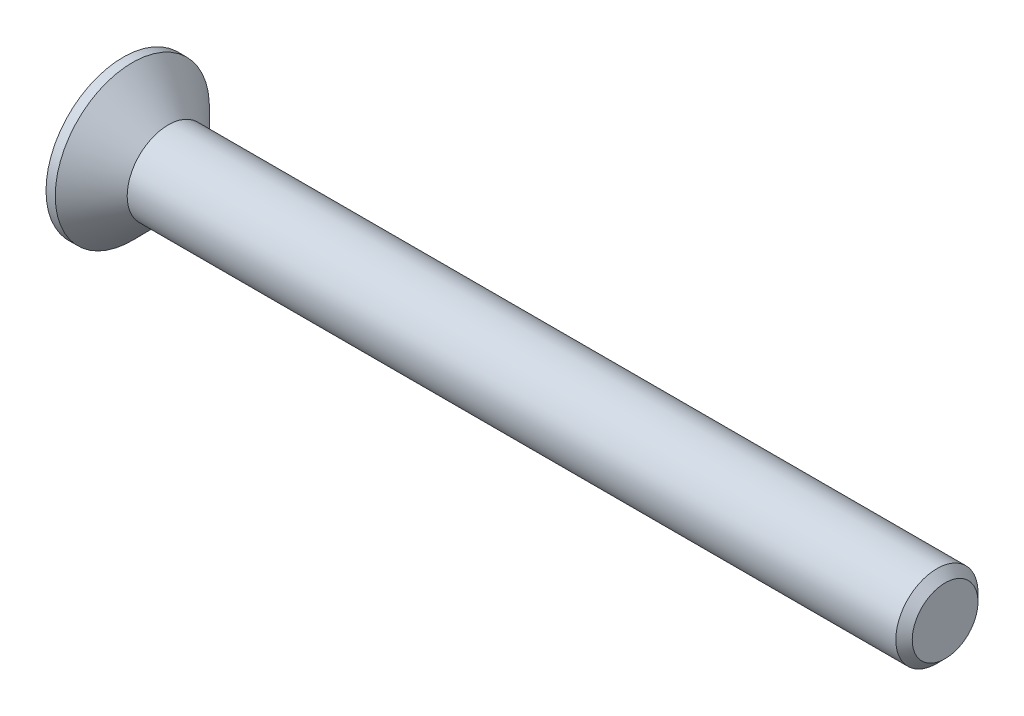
ISO-10303-21;
HEADER;
FILE_DESCRIPTION(('STEP AP214'),'2;1');
FILE_NAME('part.step','',(''),(''),'','','');
FILE_SCHEMA(('AUTOMOTIVE_DESIGN { 1 0 10303 214 1 1 1 1 }'));
ENDSEC;
DATA;
#1=APPLICATION_CONTEXT('core data for automotive mechanical design processes');
#2=APPLICATION_PROTOCOL_DEFINITION('international standard','automotive_design',2000,#1);
#3=PRODUCT_CONTEXT('',#1,'mechanical');
#4=PRODUCT('Part','Part','',(#3));
#5=PRODUCT_RELATED_PRODUCT_CATEGORY('part','',(#4));
#6=PRODUCT_DEFINITION_FORMATION('','',#4);
#7=PRODUCT_DEFINITION_CONTEXT('part definition',#1,'design');
#8=PRODUCT_DEFINITION('design','',#6,#7);
#9=PRODUCT_DEFINITION_SHAPE('','',#8);
#10=(LENGTH_UNIT() NAMED_UNIT(*) SI_UNIT(.MILLI.,.METRE.));
#11=(NAMED_UNIT(*) PLANE_ANGLE_UNIT() SI_UNIT($,.RADIAN.));
#12=(NAMED_UNIT(*) SI_UNIT($,.STERADIAN.) SOLID_ANGLE_UNIT());
#13=UNCERTAINTY_MEASURE_WITH_UNIT(LENGTH_MEASURE(1.E-05),#10,'distance_accuracy_value','');
#14=(GEOMETRIC_REPRESENTATION_CONTEXT(3) GLOBAL_UNCERTAINTY_ASSIGNED_CONTEXT((#13)) GLOBAL_UNIT_ASSIGNED_CONTEXT((#10,
#11,#12)) REPRESENTATION_CONTEXT('',''));
#15=CARTESIAN_POINT('',(0.,0.,0.));
#16=DIRECTION('',(0.,0.,1.));
#17=DIRECTION('',(1.,0.,0.));
#18=AXIS2_PLACEMENT_3D('',#15,#16,#17);
#19=CARTESIAN_POINT('',(0.,0.,0.));
#20=DIRECTION('',(-1.,0.,0.));
#21=DIRECTION('',(0.,0.,1.));
#22=AXIS2_PLACEMENT_3D('',#19,#20,#21);
#23=CONICAL_SURFACE('',#22,2.,0.78539816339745);
#24=CARTESIAN_POINT('',(-1.74999999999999,0.,0.));
#25=DIRECTION('',(-1.,0.,0.));
#26=DIRECTION('',(0.,0.,1.));
#27=AXIS2_PLACEMENT_3D('',#24,#25,#26);
#28=CIRCLE('',#27,3.75);
#29=CARTESIAN_POINT('',(-1.74999999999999,0.,3.75));
#30=VERTEX_POINT('',#29);
#31=EDGE_CURVE('E189',#30,#30,#28,.T.);
#32=ORIENTED_EDGE('',*,*,#31,.F.);
#33=EDGE_LOOP('',(#32));
#34=FACE_BOUND('',#33,.T.);
#35=CARTESIAN_POINT('',(0.,0.,0.));
#36=DIRECTION('',(-1.,0.,0.));
#37=DIRECTION('',(0.,0.,1.));
#38=AXIS2_PLACEMENT_3D('',#35,#36,#37);
#39=CIRCLE('',#38,2.);
#40=CARTESIAN_POINT('',(0.,0.,2.));
#41=VERTEX_POINT('',#40);
#42=EDGE_CURVE('E212',#41,#41,#39,.T.);
#43=ORIENTED_EDGE('',*,*,#42,.T.);
#44=EDGE_LOOP('',(#43));
#45=FACE_BOUND('',#44,.T.);
#46=ADVANCED_FACE('F33',(#34,#45),#23,.T.);
#47=CARTESIAN_POINT('',(-2.2,0.,0.));
#48=DIRECTION('',(-1.,0.,0.));
#49=DIRECTION('',(0.,0.,1.));
#50=AXIS2_PLACEMENT_3D('',#47,#48,#49);
#51=CYLINDRICAL_SURFACE('',#50,2.);
#52=CARTESIAN_POINT('',(37.4,0.,0.));
#53=DIRECTION('',(-1.,0.,0.));
#54=DIRECTION('',(0.,0.,1.));
#55=AXIS2_PLACEMENT_3D('',#52,#53,#54);
#56=CIRCLE('',#55,2.);
#57=CARTESIAN_POINT('',(37.4,0.,2.));
#58=VERTEX_POINT('',#57);
#59=EDGE_CURVE('E41',#58,#58,#56,.T.);
#60=ORIENTED_EDGE('',*,*,#59,.T.);
#61=EDGE_LOOP('',(#60));
#62=FACE_BOUND('',#61,.T.);
#63=ORIENTED_EDGE('',*,*,#42,.F.);
#64=EDGE_LOOP('',(#63));
#65=FACE_BOUND('',#64,.T.);
#66=ADVANCED_FACE('F217',(#62,#65),#51,.T.);
#67=CARTESIAN_POINT('',(37.8,0.,0.));
#68=DIRECTION('',(-1.,0.,0.));
#69=DIRECTION('',(0.,0.,1.));
#70=AXIS2_PLACEMENT_3D('',#67,#68,#69);
#71=PLANE('',#70);
#72=CARTESIAN_POINT('',(37.8,0.,0.));
#73=DIRECTION('',(-1.,0.,0.));
#74=DIRECTION('',(0.,0.,1.));
#75=AXIS2_PLACEMENT_3D('',#72,#73,#74);
#76=CIRCLE('',#75,1.59999999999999);
#77=CARTESIAN_POINT('',(37.8,0.,1.59999999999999));
#78=VERTEX_POINT('',#77);
#79=EDGE_CURVE('E11',#78,#78,#76,.F.);
#80=ORIENTED_EDGE('',*,*,#79,.T.);
#81=EDGE_LOOP('',(#80));
#82=FACE_BOUND('',#81,.T.);
#83=ADVANCED_FACE('F239',(#82),#71,.F.);
#84=CARTESIAN_POINT('',(-2.2,3.75,0.));
#85=DIRECTION('',(1.,0.,0.));
#86=DIRECTION('',(0.,0.,-1.));
#87=AXIS2_PLACEMENT_3D('',#84,#85,#86);
#88=PLANE('',#87);
#89=DIRECTION('',(0.,0.,-1.));
#90=VECTOR('',#89,1.);
#91=CARTESIAN_POINT('',(-2.2,0.55,-2.2));
#92=LINE('',#91,#90);
#93=CARTESIAN_POINT('',(-2.2,0.55,-0.55));
#94=VERTEX_POINT('',#93);
#95=CARTESIAN_POINT('',(-2.2,0.55,-2.2));
#96=VERTEX_POINT('',#95);
#97=EDGE_CURVE('E158',#94,#96,#92,.T.);
#98=ORIENTED_EDGE('',*,*,#97,.F.);
#99=DIRECTION('',(0.,-1.,0.));
#100=VECTOR('',#99,1.);
#101=CARTESIAN_POINT('',(-2.2,0.55,-0.55));
#102=LINE('',#101,#100);
#103=CARTESIAN_POINT('',(-2.2,2.2,-0.55));
#104=VERTEX_POINT('',#103);
#105=EDGE_CURVE('E48',#104,#94,#102,.T.);
#106=ORIENTED_EDGE('',*,*,#105,.F.);
#107=DIRECTION('',(0.,0.,-1.));
#108=VECTOR('',#107,1.);
#109=CARTESIAN_POINT('',(-2.2,2.2,-0.55));
#110=LINE('',#109,#108);
#111=CARTESIAN_POINT('',(-2.2,2.2,0.55));
#112=VERTEX_POINT('',#111);
#113=EDGE_CURVE('E185',#112,#104,#110,.T.);
#114=ORIENTED_EDGE('',*,*,#113,.F.);
#115=DIRECTION('',(0.,1.,0.));
#116=VECTOR('',#115,1.);
#117=CARTESIAN_POINT('',(-2.2,2.2,0.55));
#118=LINE('',#117,#116);
#119=CARTESIAN_POINT('',(-2.2,0.55,0.55));
#120=VERTEX_POINT('',#119);
#121=EDGE_CURVE('E183',#120,#112,#118,.T.);
#122=ORIENTED_EDGE('',*,*,#121,.F.);
#123=DIRECTION('',(0.,0.,-1.));
#124=VECTOR('',#123,1.);
#125=CARTESIAN_POINT('',(-2.2,0.55,0.55));
#126=LINE('',#125,#124);
#127=CARTESIAN_POINT('',(-2.2,0.55,2.2));
#128=VERTEX_POINT('',#127);
#129=EDGE_CURVE('E132',#128,#120,#126,.T.);
#130=ORIENTED_EDGE('',*,*,#129,.F.);
#131=DIRECTION('',(0.,1.,0.));
#132=VECTOR('',#131,1.);
#133=CARTESIAN_POINT('',(-2.2,0.55,2.2));
#134=LINE('',#133,#132);
#135=CARTESIAN_POINT('',(-2.2,-0.55,2.2));
#136=VERTEX_POINT('',#135);
#137=EDGE_CURVE('E179',#136,#128,#134,.T.);
#138=ORIENTED_EDGE('',*,*,#137,.F.);
#139=DIRECTION('',(0.,0.,1.));
#140=VECTOR('',#139,1.);
#141=CARTESIAN_POINT('',(-2.2,-0.55,2.2));
#142=LINE('',#141,#140);
#143=CARTESIAN_POINT('',(-2.2,-0.55,0.55));
#144=VERTEX_POINT('',#143);
#145=EDGE_CURVE('E176',#144,#136,#142,.T.);
#146=ORIENTED_EDGE('',*,*,#145,.F.);
#147=DIRECTION('',(0.,1.,0.));
#148=VECTOR('',#147,1.);
#149=CARTESIAN_POINT('',(-2.2,-0.55,0.55));
#150=LINE('',#149,#148);
#151=CARTESIAN_POINT('',(-2.2,-2.2,0.55));
#152=VERTEX_POINT('',#151);
#153=EDGE_CURVE('E173',#152,#144,#150,.T.);
#154=ORIENTED_EDGE('',*,*,#153,.F.);
#155=DIRECTION('',(0.,0.,1.));
#156=VECTOR('',#155,1.);
#157=CARTESIAN_POINT('',(-2.2,-2.2,0.55));
#158=LINE('',#157,#156);
#159=CARTESIAN_POINT('',(-2.2,-2.2,-0.55));
#160=VERTEX_POINT('',#159);
#161=EDGE_CURVE('E170',#160,#152,#158,.T.);
#162=ORIENTED_EDGE('',*,*,#161,.F.);
#163=DIRECTION('',(0.,-1.,0.));
#164=VECTOR('',#163,1.);
#165=CARTESIAN_POINT('',(-2.2,-2.2,-0.55));
#166=LINE('',#165,#164);
#167=CARTESIAN_POINT('',(-2.2,-0.55,-0.55));
#168=VERTEX_POINT('',#167);
#169=EDGE_CURVE('E167',#168,#160,#166,.T.);
#170=ORIENTED_EDGE('',*,*,#169,.F.);
#171=DIRECTION('',(0.,0.,1.));
#172=VECTOR('',#171,1.);
#173=CARTESIAN_POINT('',(-2.2,-0.55,-0.55));
#174=LINE('',#173,#172);
#175=CARTESIAN_POINT('',(-2.2,-0.55,-2.2));
#176=VERTEX_POINT('',#175);
#177=EDGE_CURVE('E164',#176,#168,#174,.T.);
#178=ORIENTED_EDGE('',*,*,#177,.F.);
#179=DIRECTION('',(0.,-1.,0.));
#180=VECTOR('',#179,1.);
#181=CARTESIAN_POINT('',(-2.2,-0.55,-2.2));
#182=LINE('',#181,#180);
#183=EDGE_CURVE('E161',#96,#176,#182,.T.);
#184=ORIENTED_EDGE('',*,*,#183,.F.);
#185=EDGE_LOOP('',(#98,#106,#114,#122,#130,#138,#146,#154,#162,#170,#178,#184));
#186=FACE_BOUND('',#185,.T.);
#187=CARTESIAN_POINT('',(-2.2,0.,0.));
#188=DIRECTION('',(-1.,0.,0.));
#189=DIRECTION('',(0.,0.,1.));
#190=AXIS2_PLACEMENT_3D('',#187,#188,#189);
#191=CIRCLE('',#190,3.75);
#192=CARTESIAN_POINT('',(-2.2,0.,3.75));
#193=VERTEX_POINT('',#192);
#194=EDGE_CURVE('E209',#193,#193,#191,.T.);
#195=ORIENTED_EDGE('',*,*,#194,.T.);
#196=EDGE_LOOP('',(#195));
#197=FACE_BOUND('',#196,.T.);
#198=ADVANCED_FACE('F230',(#186,#197),#88,.F.);
#199=CARTESIAN_POINT('',(-2.2,0.,0.));
#200=DIRECTION('',(-1.,0.,0.));
#201=DIRECTION('',(0.,0.,1.));
#202=AXIS2_PLACEMENT_3D('',#199,#200,#201);
#203=CYLINDRICAL_SURFACE('',#202,3.75);
#204=ORIENTED_EDGE('',*,*,#194,.F.);
#205=EDGE_LOOP('',(#204));
#206=FACE_BOUND('',#205,.T.);
#207=ORIENTED_EDGE('',*,*,#31,.T.);
#208=EDGE_LOOP('',(#207));
#209=FACE_BOUND('',#208,.T.);
#210=ADVANCED_FACE('F222',(#206,#209),#203,.T.);
#211=CARTESIAN_POINT('',(37.4,0.,0.));
#212=DIRECTION('',(-1.,0.,0.));
#213=DIRECTION('',(0.,0.,1.));
#214=AXIS2_PLACEMENT_3D('',#211,#212,#213);
#215=CONICAL_SURFACE('',#214,2.,0.785398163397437);
#216=ORIENTED_EDGE('',*,*,#79,.F.);
#217=EDGE_LOOP('',(#216));
#218=FACE_BOUND('',#217,.T.);
#219=ORIENTED_EDGE('',*,*,#59,.F.);
#220=EDGE_LOOP('',(#219));
#221=FACE_BOUND('',#220,.T.);
#222=ADVANCED_FACE('F35',(#218,#221),#215,.T.);
#223=CARTESIAN_POINT('',(-0.3,0.55,-0.55));
#224=DIRECTION('',(0.,0.,-1.));
#225=DIRECTION('',(-1.,0.,0.));
#226=AXIS2_PLACEMENT_3D('',#223,#224,#225);
#227=PLANE('',#226);
#228=ORIENTED_EDGE('',*,*,#105,.T.);
#229=DIRECTION('',(-1.,0.,0.));
#230=VECTOR('',#229,1.);
#231=CARTESIAN_POINT('',(-0.3,0.55,-0.55));
#232=LINE('',#231,#230);
#233=CARTESIAN_POINT('',(-0.3,0.55,-0.55));
#234=VERTEX_POINT('',#233);
#235=EDGE_CURVE('E96',#234,#94,#232,.T.);
#236=ORIENTED_EDGE('',*,*,#235,.F.);
#237=DIRECTION('',(0.,-1.,0.));
#238=VECTOR('',#237,1.);
#239=CARTESIAN_POINT('',(-0.3,0.55,-0.55));
#240=LINE('',#239,#238);
#241=CARTESIAN_POINT('',(-0.3,2.2,-0.55));
#242=VERTEX_POINT('',#241);
#243=EDGE_CURVE('E187',#242,#234,#240,.T.);
#244=ORIENTED_EDGE('',*,*,#243,.F.);
#245=DIRECTION('',(-1.,0.,0.));
#246=VECTOR('',#245,1.);
#247=CARTESIAN_POINT('',(-0.3,2.2,-0.55));
#248=LINE('',#247,#246);
#249=EDGE_CURVE('E56',#242,#104,#248,.T.);
#250=ORIENTED_EDGE('',*,*,#249,.T.);
#251=EDGE_LOOP('',(#228,#236,#244,#250));
#252=FACE_BOUND('',#251,.T.);
#253=ADVANCED_FACE('F221',(#252),#227,.F.);
#254=CARTESIAN_POINT('',(-0.3,2.2,-0.55));
#255=DIRECTION('',(0.,1.,0.));
#256=DIRECTION('',(-1.,0.,0.));
#257=AXIS2_PLACEMENT_3D('',#254,#255,#256);
#258=PLANE('',#257);
#259=ORIENTED_EDGE('',*,*,#113,.T.);
#260=ORIENTED_EDGE('',*,*,#249,.F.);
#261=DIRECTION('',(0.,0.,-1.));
#262=VECTOR('',#261,1.);
#263=CARTESIAN_POINT('',(-0.3,2.2,-0.55));
#264=LINE('',#263,#262);
#265=CARTESIAN_POINT('',(-0.3,2.2,0.55));
#266=VERTEX_POINT('',#265);
#267=EDGE_CURVE('E144',#266,#242,#264,.T.);
#268=ORIENTED_EDGE('',*,*,#267,.F.);
#269=DIRECTION('',(-1.,0.,0.));
#270=VECTOR('',#269,1.);
#271=CARTESIAN_POINT('',(-0.3,2.2,0.55));
#272=LINE('',#271,#270);
#273=EDGE_CURVE('E136',#266,#112,#272,.T.);
#274=ORIENTED_EDGE('',*,*,#273,.T.);
#275=EDGE_LOOP('',(#259,#260,#268,#274));
#276=FACE_BOUND('',#275,.T.);
#277=ADVANCED_FACE('F228',(#276),#258,.F.);
#278=CARTESIAN_POINT('',(-0.3,2.2,0.55));
#279=DIRECTION('',(0.,0.,1.));
#280=DIRECTION('',(1.,0.,0.));
#281=AXIS2_PLACEMENT_3D('',#278,#279,#280);
#282=PLANE('',#281);
#283=ORIENTED_EDGE('',*,*,#121,.T.);
#284=ORIENTED_EDGE('',*,*,#273,.F.);
#285=DIRECTION('',(0.,1.,0.));
#286=VECTOR('',#285,1.);
#287=CARTESIAN_POINT('',(-0.3,2.2,0.55));
#288=LINE('',#287,#286);
#289=CARTESIAN_POINT('',(-0.3,0.55,0.55));
#290=VERTEX_POINT('',#289);
#291=EDGE_CURVE('E140',#290,#266,#288,.T.);
#292=ORIENTED_EDGE('',*,*,#291,.F.);
#293=DIRECTION('',(-1.,0.,0.));
#294=VECTOR('',#293,1.);
#295=CARTESIAN_POINT('',(-0.3,0.55,0.55));
#296=LINE('',#295,#294);
#297=EDGE_CURVE('E125',#290,#120,#296,.T.);
#298=ORIENTED_EDGE('',*,*,#297,.T.);
#299=EDGE_LOOP('',(#283,#284,#292,#298));
#300=FACE_BOUND('',#299,.T.);
#301=ADVANCED_FACE('F141',(#300),#282,.F.);
#302=CARTESIAN_POINT('',(-0.3,0.55,0.55));
#303=DIRECTION('',(0.,1.,0.));
#304=DIRECTION('',(-1.,0.,0.));
#305=AXIS2_PLACEMENT_3D('',#302,#303,#304);
#306=PLANE('',#305);
#307=ORIENTED_EDGE('',*,*,#129,.T.);
#308=ORIENTED_EDGE('',*,*,#297,.F.);
#309=DIRECTION('',(0.,0.,-1.));
#310=VECTOR('',#309,1.);
#311=CARTESIAN_POINT('',(-0.3,0.55,0.55));
#312=LINE('',#311,#310);
#313=CARTESIAN_POINT('',(-0.3,0.55,2.2));
#314=VERTEX_POINT('',#313);
#315=EDGE_CURVE('E129',#314,#290,#312,.T.);
#316=ORIENTED_EDGE('',*,*,#315,.F.);
#317=DIRECTION('',(-1.,0.,0.));
#318=VECTOR('',#317,1.);
#319=CARTESIAN_POINT('',(-0.3,0.55,2.2));
#320=LINE('',#319,#318);
#321=EDGE_CURVE('E137',#314,#128,#320,.T.);
#322=ORIENTED_EDGE('',*,*,#321,.T.);
#323=EDGE_LOOP('',(#307,#308,#316,#322));
#324=FACE_BOUND('',#323,.T.);
#325=ADVANCED_FACE('F127',(#324),#306,.F.);
#326=CARTESIAN_POINT('',(-0.3,0.55,2.2));
#327=DIRECTION('',(0.,0.,1.));
#328=DIRECTION('',(1.,0.,0.));
#329=AXIS2_PLACEMENT_3D('',#326,#327,#328);
#330=PLANE('',#329);
#331=ORIENTED_EDGE('',*,*,#137,.T.);
#332=ORIENTED_EDGE('',*,*,#321,.F.);
#333=DIRECTION('',(0.,1.,0.));
#334=VECTOR('',#333,1.);
#335=CARTESIAN_POINT('',(-0.3,0.55,2.2));
#336=LINE('',#335,#334);
#337=CARTESIAN_POINT('',(-0.3,-0.55,2.2));
#338=VERTEX_POINT('',#337);
#339=EDGE_CURVE('E150',#338,#314,#336,.T.);
#340=ORIENTED_EDGE('',*,*,#339,.F.);
#341=DIRECTION('',(-1.,0.,0.));
#342=VECTOR('',#341,1.);
#343=CARTESIAN_POINT('',(-0.3,-0.55,2.2));
#344=LINE('',#343,#342);
#345=EDGE_CURVE('E192',#338,#136,#344,.T.);
#346=ORIENTED_EDGE('',*,*,#345,.T.);
#347=EDGE_LOOP('',(#331,#332,#340,#346));
#348=FACE_BOUND('',#347,.T.);
#349=ADVANCED_FACE('F277',(#348),#330,.F.);
#350=CARTESIAN_POINT('',(-0.3,-0.55,2.2));
#351=DIRECTION('',(0.,-1.,0.));
#352=DIRECTION('',(1.,0.,0.));
#353=AXIS2_PLACEMENT_3D('',#350,#351,#352);
#354=PLANE('',#353);
#355=ORIENTED_EDGE('',*,*,#145,.T.);
#356=ORIENTED_EDGE('',*,*,#345,.F.);
#357=DIRECTION('',(0.,0.,1.));
#358=VECTOR('',#357,1.);
#359=CARTESIAN_POINT('',(-0.3,-0.55,2.2));
#360=LINE('',#359,#358);
#361=CARTESIAN_POINT('',(-0.3,-0.55,0.55));
#362=VERTEX_POINT('',#361);
#363=EDGE_CURVE('E152',#362,#338,#360,.T.);
#364=ORIENTED_EDGE('',*,*,#363,.F.);
#365=DIRECTION('',(-1.,0.,0.));
#366=VECTOR('',#365,1.);
#367=CARTESIAN_POINT('',(-0.3,-0.55,0.55));
#368=LINE('',#367,#366);
#369=EDGE_CURVE('E194',#362,#144,#368,.T.);
#370=ORIENTED_EDGE('',*,*,#369,.T.);
#371=EDGE_LOOP('',(#355,#356,#364,#370));
#372=FACE_BOUND('',#371,.T.);
#373=ADVANCED_FACE('F273',(#372),#354,.F.);
#374=CARTESIAN_POINT('',(-0.3,-0.55,0.55));
#375=DIRECTION('',(0.,0.,1.));
#376=DIRECTION('',(1.,0.,0.));
#377=AXIS2_PLACEMENT_3D('',#374,#375,#376);
#378=PLANE('',#377);
#379=ORIENTED_EDGE('',*,*,#153,.T.);
#380=ORIENTED_EDGE('',*,*,#369,.F.);
#381=DIRECTION('',(0.,1.,0.));
#382=VECTOR('',#381,1.);
#383=CARTESIAN_POINT('',(-0.3,-0.55,0.55));
#384=LINE('',#383,#382);
#385=CARTESIAN_POINT('',(-0.3,-2.2,0.55));
#386=VERTEX_POINT('',#385);
#387=EDGE_CURVE('E422',#386,#362,#384,.T.);
#388=ORIENTED_EDGE('',*,*,#387,.F.);
#389=DIRECTION('',(-1.,0.,0.));
#390=VECTOR('',#389,1.);
#391=CARTESIAN_POINT('',(-0.3,-2.2,0.55));
#392=LINE('',#391,#390);
#393=EDGE_CURVE('E196',#386,#152,#392,.T.);
#394=ORIENTED_EDGE('',*,*,#393,.T.);
#395=EDGE_LOOP('',(#379,#380,#388,#394));
#396=FACE_BOUND('',#395,.T.);
#397=ADVANCED_FACE('F269',(#396),#378,.F.);
#398=CARTESIAN_POINT('',(-0.3,-2.2,0.55));
#399=DIRECTION('',(0.,-1.,0.));
#400=DIRECTION('',(1.,0.,0.));
#401=AXIS2_PLACEMENT_3D('',#398,#399,#400);
#402=PLANE('',#401);
#403=ORIENTED_EDGE('',*,*,#161,.T.);
#404=ORIENTED_EDGE('',*,*,#393,.F.);
#405=DIRECTION('',(0.,0.,1.));
#406=VECTOR('',#405,1.);
#407=CARTESIAN_POINT('',(-0.3,-2.2,0.55));
#408=LINE('',#407,#406);
#409=CARTESIAN_POINT('',(-0.3,-2.2,-0.55));
#410=VERTEX_POINT('',#409);
#411=EDGE_CURVE('E419',#410,#386,#408,.T.);
#412=ORIENTED_EDGE('',*,*,#411,.F.);
#413=DIRECTION('',(-1.,0.,0.));
#414=VECTOR('',#413,1.);
#415=CARTESIAN_POINT('',(-0.3,-2.2,-0.55));
#416=LINE('',#415,#414);
#417=EDGE_CURVE('E198',#410,#160,#416,.T.);
#418=ORIENTED_EDGE('',*,*,#417,.T.);
#419=EDGE_LOOP('',(#403,#404,#412,#418));
#420=FACE_BOUND('',#419,.T.);
#421=ADVANCED_FACE('F265',(#420),#402,.F.);
#422=CARTESIAN_POINT('',(-0.3,-2.2,-0.55));
#423=DIRECTION('',(0.,0.,-1.));
#424=DIRECTION('',(-1.,0.,0.));
#425=AXIS2_PLACEMENT_3D('',#422,#423,#424);
#426=PLANE('',#425);
#427=ORIENTED_EDGE('',*,*,#169,.T.);
#428=ORIENTED_EDGE('',*,*,#417,.F.);
#429=DIRECTION('',(0.,-1.,0.));
#430=VECTOR('',#429,1.);
#431=CARTESIAN_POINT('',(-0.3,-2.2,-0.55));
#432=LINE('',#431,#430);
#433=CARTESIAN_POINT('',(-0.3,-0.55,-0.55));
#434=VERTEX_POINT('',#433);
#435=EDGE_CURVE('E416',#434,#410,#432,.T.);
#436=ORIENTED_EDGE('',*,*,#435,.F.);
#437=DIRECTION('',(-1.,0.,0.));
#438=VECTOR('',#437,1.);
#439=CARTESIAN_POINT('',(-0.3,-0.55,-0.55));
#440=LINE('',#439,#438);
#441=EDGE_CURVE('E200',#434,#168,#440,.T.);
#442=ORIENTED_EDGE('',*,*,#441,.T.);
#443=EDGE_LOOP('',(#427,#428,#436,#442));
#444=FACE_BOUND('',#443,.T.);
#445=ADVANCED_FACE('F261',(#444),#426,.F.);
#446=CARTESIAN_POINT('',(-0.3,-0.55,-0.55));
#447=DIRECTION('',(0.,-1.,0.));
#448=DIRECTION('',(1.,0.,0.));
#449=AXIS2_PLACEMENT_3D('',#446,#447,#448);
#450=PLANE('',#449);
#451=ORIENTED_EDGE('',*,*,#177,.T.);
#452=ORIENTED_EDGE('',*,*,#441,.F.);
#453=DIRECTION('',(0.,0.,1.));
#454=VECTOR('',#453,1.);
#455=CARTESIAN_POINT('',(-0.3,-0.55,-0.55));
#456=LINE('',#455,#454);
#457=CARTESIAN_POINT('',(-0.3,-0.55,-2.2));
#458=VERTEX_POINT('',#457);
#459=EDGE_CURVE('E413',#458,#434,#456,.T.);
#460=ORIENTED_EDGE('',*,*,#459,.F.);
#461=DIRECTION('',(-1.,0.,0.));
#462=VECTOR('',#461,1.);
#463=CARTESIAN_POINT('',(-0.3,-0.55,-2.2));
#464=LINE('',#463,#462);
#465=EDGE_CURVE('E202',#458,#176,#464,.T.);
#466=ORIENTED_EDGE('',*,*,#465,.T.);
#467=EDGE_LOOP('',(#451,#452,#460,#466));
#468=FACE_BOUND('',#467,.T.);
#469=ADVANCED_FACE('F257',(#468),#450,.F.);
#470=CARTESIAN_POINT('',(-0.3,-0.55,-2.2));
#471=DIRECTION('',(0.,0.,-1.));
#472=DIRECTION('',(-1.,0.,0.));
#473=AXIS2_PLACEMENT_3D('',#470,#471,#472);
#474=PLANE('',#473);
#475=ORIENTED_EDGE('',*,*,#183,.T.);
#476=ORIENTED_EDGE('',*,*,#465,.F.);
#477=DIRECTION('',(0.,-1.,0.));
#478=VECTOR('',#477,1.);
#479=CARTESIAN_POINT('',(-0.3,-0.55,-2.2));
#480=LINE('',#479,#478);
#481=CARTESIAN_POINT('',(-0.3,0.55,-2.2));
#482=VERTEX_POINT('',#481);
#483=EDGE_CURVE('E408',#482,#458,#480,.T.);
#484=ORIENTED_EDGE('',*,*,#483,.F.);
#485=DIRECTION('',(-1.,0.,0.));
#486=VECTOR('',#485,1.);
#487=CARTESIAN_POINT('',(-0.3,0.55,-2.2));
#488=LINE('',#487,#486);
#489=EDGE_CURVE('E204',#482,#96,#488,.T.);
#490=ORIENTED_EDGE('',*,*,#489,.T.);
#491=EDGE_LOOP('',(#475,#476,#484,#490));
#492=FACE_BOUND('',#491,.T.);
#493=ADVANCED_FACE('F253',(#492),#474,.F.);
#494=CARTESIAN_POINT('',(-0.3,0.55,-2.2));
#495=DIRECTION('',(0.,1.,0.));
#496=DIRECTION('',(-1.,0.,0.));
#497=AXIS2_PLACEMENT_3D('',#494,#495,#496);
#498=PLANE('',#497);
#499=ORIENTED_EDGE('',*,*,#97,.T.);
#500=ORIENTED_EDGE('',*,*,#489,.F.);
#501=DIRECTION('',(0.,0.,-1.));
#502=VECTOR('',#501,1.);
#503=CARTESIAN_POINT('',(-0.3,0.55,-2.2));
#504=LINE('',#503,#502);
#505=EDGE_CURVE('E406',#234,#482,#504,.T.);
#506=ORIENTED_EDGE('',*,*,#505,.F.);
#507=ORIENTED_EDGE('',*,*,#235,.T.);
#508=EDGE_LOOP('',(#499,#500,#506,#507));
#509=FACE_BOUND('',#508,.T.);
#510=ADVANCED_FACE('F250',(#509),#498,.F.);
#511=CARTESIAN_POINT('',(-0.3,0.,0.));
#512=DIRECTION('',(1.,0.,0.));
#513=DIRECTION('',(0.,0.,-1.));
#514=AXIS2_PLACEMENT_3D('',#511,#512,#513);
#515=PLANE('',#514);
#516=ORIENTED_EDGE('',*,*,#243,.T.);
#517=ORIENTED_EDGE('',*,*,#505,.T.);
#518=ORIENTED_EDGE('',*,*,#483,.T.);
#519=ORIENTED_EDGE('',*,*,#459,.T.);
#520=ORIENTED_EDGE('',*,*,#435,.T.);
#521=ORIENTED_EDGE('',*,*,#411,.T.);
#522=ORIENTED_EDGE('',*,*,#387,.T.);
#523=ORIENTED_EDGE('',*,*,#363,.T.);
#524=ORIENTED_EDGE('',*,*,#339,.T.);
#525=ORIENTED_EDGE('',*,*,#315,.T.);
#526=ORIENTED_EDGE('',*,*,#291,.T.);
#527=ORIENTED_EDGE('',*,*,#267,.T.);
#528=EDGE_LOOP('',(#516,#517,#518,#519,#520,#521,#522,#523,#524,#525,#526,#527));
#529=FACE_BOUND('',#528,.T.);
#530=ADVANCED_FACE('F147',(#529),#515,.F.);
#531=CLOSED_SHELL('',(#46,#66,#83,#198,#210,#222,#253,#277,#301,#325,#349,#373,#397,#421,#445,
#469,#493,#510,#530));
#532=MANIFOLD_SOLID_BREP('B2',#531);
#533=ADVANCED_BREP_SHAPE_REPRESENTATION('',(#18,#532),#14);
#534=SHAPE_DEFINITION_REPRESENTATION(#9,#533);
ENDSEC;
END-ISO-10303-21;
